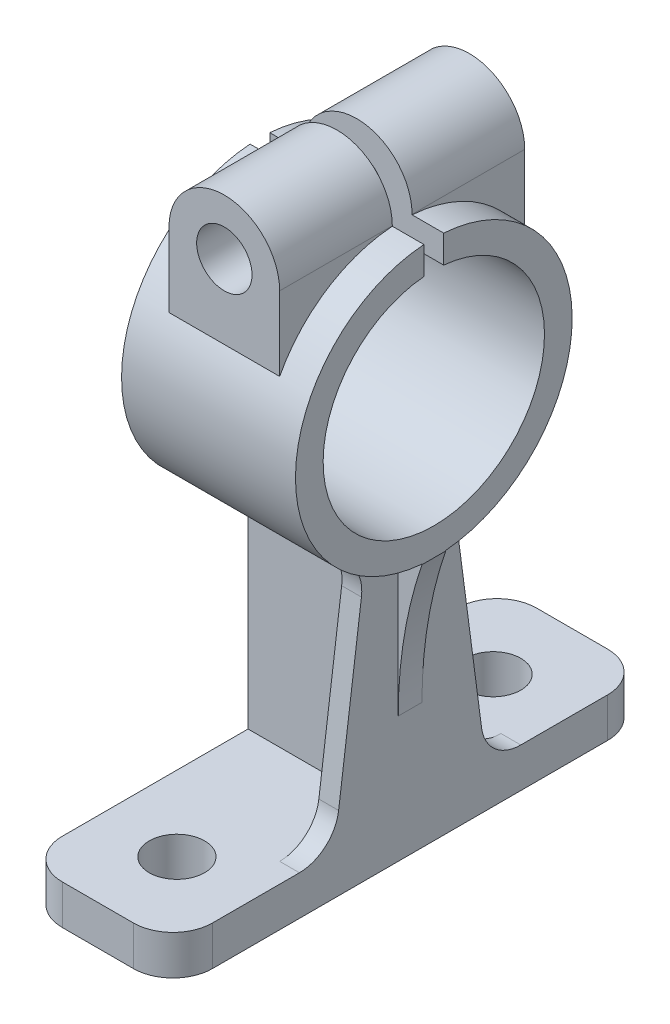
ISO-10303-21;
HEADER;
FILE_DESCRIPTION(('STEP AP214'),'2;1');
FILE_NAME('part.step','',(''),(''),'','','');
FILE_SCHEMA(('AUTOMOTIVE_DESIGN { 1 0 10303 214 1 1 1 1 }'));
ENDSEC;
DATA;
#1=APPLICATION_CONTEXT('core data for automotive mechanical design processes');
#2=APPLICATION_PROTOCOL_DEFINITION('international standard','automotive_design',2000,#1);
#3=PRODUCT_CONTEXT('',#1,'mechanical');
#4=PRODUCT('Part','Part','',(#3));
#5=PRODUCT_RELATED_PRODUCT_CATEGORY('part','',(#4));
#6=PRODUCT_DEFINITION_FORMATION('','',#4);
#7=PRODUCT_DEFINITION_CONTEXT('part definition',#1,'design');
#8=PRODUCT_DEFINITION('design','',#6,#7);
#9=PRODUCT_DEFINITION_SHAPE('','',#8);
#10=(LENGTH_UNIT() NAMED_UNIT(*) SI_UNIT(.MILLI.,.METRE.));
#11=(NAMED_UNIT(*) PLANE_ANGLE_UNIT() SI_UNIT($,.RADIAN.));
#12=(NAMED_UNIT(*) SI_UNIT($,.STERADIAN.) SOLID_ANGLE_UNIT());
#13=UNCERTAINTY_MEASURE_WITH_UNIT(LENGTH_MEASURE(1.E-05),#10,'distance_accuracy_value','');
#14=(GEOMETRIC_REPRESENTATION_CONTEXT(3) GLOBAL_UNCERTAINTY_ASSIGNED_CONTEXT((#13)) GLOBAL_UNIT_ASSIGNED_CONTEXT((#10,
#11,#12)) REPRESENTATION_CONTEXT('',''));
#15=CARTESIAN_POINT('',(0.,0.,0.));
#16=DIRECTION('',(0.,0.,1.));
#17=DIRECTION('',(1.,0.,0.));
#18=AXIS2_PLACEMENT_3D('',#15,#16,#17);
#19=CARTESIAN_POINT('',(-38.,103.,0.));
#20=DIRECTION('',(1.,0.,0.));
#21=DIRECTION('',(0.,0.,-1.));
#22=AXIS2_PLACEMENT_3D('',#19,#20,#21);
#23=CYLINDRICAL_SURFACE('',#22,35.);
#24=DIRECTION('',(1.,0.,0.));
#25=VECTOR('',#24,1.);
#26=CARTESIAN_POINT('',(-38.,137.910600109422,-2.5));
#27=LINE('',#26,#25);
#28=CARTESIAN_POINT('',(-1.99999999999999,137.910600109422,-2.5));
#29=VERTEX_POINT('',#28);
#30=CARTESIAN_POINT('',(6.00000000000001,137.910600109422,-2.5));
#31=VERTEX_POINT('',#30);
#32=EDGE_CURVE('E285',#29,#31,#27,.T.);
#33=ORIENTED_EDGE('',*,*,#32,.T.);
#34=CARTESIAN_POINT('',(6.00000000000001,103.,0.));
#35=DIRECTION('',(-1.,0.,0.));
#36=DIRECTION('',(0.,0.,1.));
#37=AXIS2_PLACEMENT_3D('',#34,#35,#36);
#38=CIRCLE('',#37,35.);
#39=CARTESIAN_POINT('',(6.00000000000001,68.1288084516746,-3.));
#40=VERTEX_POINT('',#39);
#41=EDGE_CURVE('E298',#31,#40,#38,.T.);
#42=ORIENTED_EDGE('',*,*,#41,.T.);
#43=DIRECTION('',(1.,0.,0.));
#44=VECTOR('',#43,1.);
#45=CARTESIAN_POINT('',(-38.,68.1288084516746,-3.));
#46=LINE('',#45,#44);
#47=CARTESIAN_POINT('',(0.,68.1288084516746,-3.));
#48=VERTEX_POINT('',#47);
#49=EDGE_CURVE('E511',#48,#40,#46,.T.);
#50=ORIENTED_EDGE('',*,*,#49,.F.);
#51=CARTESIAN_POINT('',(0.,103.,0.));
#52=DIRECTION('',(-1.,0.,0.));
#53=DIRECTION('',(0.,0.,-1.));
#54=AXIS2_PLACEMENT_3D('',#51,#52,#53);
#55=CIRCLE('',#54,35.);
#56=CARTESIAN_POINT('',(0.,72.5663052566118,-17.2855495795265));
#57=VERTEX_POINT('',#56);
#58=EDGE_CURVE('E341',#57,#48,#55,.T.);
#59=ORIENTED_EDGE('',*,*,#58,.F.);
#60=DIRECTION('',(1.,0.,0.));
#61=VECTOR('',#60,1.);
#62=CARTESIAN_POINT('',(-5.,72.5663052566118,-17.2855495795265));
#63=LINE('',#62,#61);
#64=CARTESIAN_POINT('',(-5.,72.5663052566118,-17.2855495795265));
#65=VERTEX_POINT('',#64);
#66=EDGE_CURVE('E374',#65,#57,#63,.T.);
#67=ORIENTED_EDGE('',*,*,#66,.F.);
#68=CARTESIAN_POINT('',(-5.,103.,0.));
#69=DIRECTION('',(-1.,0.,0.));
#70=DIRECTION('',(0.,0.,-1.));
#71=AXIS2_PLACEMENT_3D('',#68,#69,#70);
#72=CIRCLE('',#71,35.);
#73=CARTESIAN_POINT('',(-5.,68.1288084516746,-3.));
#74=VERTEX_POINT('',#73);
#75=EDGE_CURVE('E366',#65,#74,#72,.T.);
#76=ORIENTED_EDGE('',*,*,#75,.T.);
#77=DIRECTION('',(1.,0.,0.));
#78=VECTOR('',#77,1.);
#79=CARTESIAN_POINT('',(-38.,68.1288084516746,-3.));
#80=LINE('',#79,#78);
#81=CARTESIAN_POINT('',(-38.,68.1288084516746,-3.));
#82=VERTEX_POINT('',#81);
#83=EDGE_CURVE('E315',#74,#82,#80,.F.);
#84=ORIENTED_EDGE('',*,*,#83,.T.);
#85=CARTESIAN_POINT('',(-38.,103.,0.));
#86=DIRECTION('',(1.,0.,0.));
#87=DIRECTION('',(0.,0.,-1.));
#88=AXIS2_PLACEMENT_3D('',#85,#86,#87);
#89=CIRCLE('',#88,35.);
#90=CARTESIAN_POINT('',(-38.,137.910600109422,-2.5));
#91=VERTEX_POINT('',#90);
#92=EDGE_CURVE('E319',#82,#91,#89,.T.);
#93=ORIENTED_EDGE('',*,*,#92,.T.);
#94=CARTESIAN_POINT('',(-30.,137.910600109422,-2.5));
#95=VERTEX_POINT('',#94);
#96=EDGE_CURVE('E302',#91,#95,#27,.T.);
#97=ORIENTED_EDGE('',*,*,#96,.T.);
#98=CARTESIAN_POINT('',(-30.,103.,0.));
#99=DIRECTION('',(1.,0.,0.));
#100=DIRECTION('',(0.,0.,-1.));
#101=AXIS2_PLACEMENT_3D('',#98,#99,#100);
#102=CIRCLE('',#101,35.);
#103=CARTESIAN_POINT('',(-30.,119.248076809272,-31.));
#104=VERTEX_POINT('',#103);
#105=EDGE_CURVE('E412',#95,#104,#102,.F.);
#106=ORIENTED_EDGE('',*,*,#105,.T.);
#107=DIRECTION('',(1.,0.,0.));
#108=VECTOR('',#107,1.);
#109=CARTESIAN_POINT('',(-38.,119.248076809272,-31.));
#110=LINE('',#109,#108);
#111=CARTESIAN_POINT('',(-1.99999999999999,119.248076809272,-31.));
#112=VERTEX_POINT('',#111);
#113=EDGE_CURVE('E409',#112,#104,#110,.F.);
#114=ORIENTED_EDGE('',*,*,#113,.F.);
#115=CARTESIAN_POINT('',(-1.99999999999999,103.,0.));
#116=DIRECTION('',(-1.,0.,0.));
#117=DIRECTION('',(0.,-1.,0.));
#118=AXIS2_PLACEMENT_3D('',#115,#116,#117);
#119=CIRCLE('',#118,35.);
#120=EDGE_CURVE('E301',#112,#29,#119,.F.);
#121=ORIENTED_EDGE('',*,*,#120,.T.);
#122=EDGE_LOOP('',(#33,#42,#50,#59,#67,#76,#84,#93,#97,#106,#114,#121));
#123=FACE_BOUND('',#122,.T.);
#124=ADVANCED_FACE('F47',(#123),#23,.T.);
#125=CARTESIAN_POINT('',(-16.,138.,31.));
#126=DIRECTION('',(0.,0.,-1.));
#127=DIRECTION('',(-1.,0.,0.));
#128=AXIS2_PLACEMENT_3D('',#125,#126,#127);
#129=CYLINDRICAL_SURFACE('',#128,14.);
#130=DIRECTION('',(0.,0.,-1.));
#131=VECTOR('',#130,1.);
#132=CARTESIAN_POINT('',(-30.,138.,31.));
#133=LINE('',#132,#131);
#134=CARTESIAN_POINT('',(-30.,138.,-2.5));
#135=VERTEX_POINT('',#134);
#136=CARTESIAN_POINT('',(-30.,138.,-31.));
#137=VERTEX_POINT('',#136);
#138=EDGE_CURVE('E601',#135,#137,#133,.T.);
#139=ORIENTED_EDGE('',*,*,#138,.F.);
#140=CARTESIAN_POINT('',(-16.,138.,-2.5));
#141=DIRECTION('',(0.,0.,-1.));
#142=DIRECTION('',(0.,1.,0.));
#143=AXIS2_PLACEMENT_3D('',#140,#141,#142);
#144=CIRCLE('',#143,14.);
#145=CARTESIAN_POINT('',(-1.99999999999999,138.,-2.5));
#146=VERTEX_POINT('',#145);
#147=EDGE_CURVE('E566',#146,#135,#144,.F.);
#148=ORIENTED_EDGE('',*,*,#147,.F.);
#149=DIRECTION('',(0.,0.,-1.));
#150=VECTOR('',#149,1.);
#151=CARTESIAN_POINT('',(-1.99999999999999,138.,31.));
#152=LINE('',#151,#150);
#153=CARTESIAN_POINT('',(-1.99999999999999,138.,-31.));
#154=VERTEX_POINT('',#153);
#155=EDGE_CURVE('E604',#146,#154,#152,.T.);
#156=ORIENTED_EDGE('',*,*,#155,.T.);
#157=CARTESIAN_POINT('',(-16.,138.,-31.));
#158=DIRECTION('',(0.,0.,1.));
#159=DIRECTION('',(-1.,0.,0.));
#160=AXIS2_PLACEMENT_3D('',#157,#158,#159);
#161=CIRCLE('',#160,14.);
#162=EDGE_CURVE('E588',#154,#137,#161,.T.);
#163=ORIENTED_EDGE('',*,*,#162,.T.);
#164=EDGE_LOOP('',(#139,#148,#156,#163));
#165=FACE_BOUND('',#164,.T.);
#166=ADVANCED_FACE('F614',(#165),#129,.T.);
#167=DIRECTION('',(1.,0.,0.));
#168=VECTOR('',#167,1.);
#169=CARTESIAN_POINT('',(-38.,137.910600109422,2.5));
#170=LINE('',#169,#168);
#171=CARTESIAN_POINT('',(-30.,137.910600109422,2.5));
#172=VERTEX_POINT('',#171);
#173=CARTESIAN_POINT('',(-38.,137.910600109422,2.5));
#174=VERTEX_POINT('',#173);
#175=EDGE_CURVE('E627',#172,#174,#170,.F.);
#176=ORIENTED_EDGE('',*,*,#175,.T.);
#177=CARTESIAN_POINT('',(-38.,68.1288084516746,3.));
#178=VERTEX_POINT('',#177);
#179=EDGE_CURVE('E313',#174,#178,#89,.T.);
#180=ORIENTED_EDGE('',*,*,#179,.T.);
#181=DIRECTION('',(1.,0.,0.));
#182=VECTOR('',#181,1.);
#183=CARTESIAN_POINT('',(-38.,68.1288084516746,3.));
#184=LINE('',#183,#182);
#185=CARTESIAN_POINT('',(-5.,68.1288084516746,3.));
#186=VERTEX_POINT('',#185);
#187=EDGE_CURVE('E310',#186,#178,#184,.F.);
#188=ORIENTED_EDGE('',*,*,#187,.F.);
#189=CARTESIAN_POINT('',(-5.,72.5663052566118,17.2855495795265));
#190=VERTEX_POINT('',#189);
#191=EDGE_CURVE('E365',#186,#190,#72,.T.);
#192=ORIENTED_EDGE('',*,*,#191,.T.);
#193=DIRECTION('',(1.,0.,0.));
#194=VECTOR('',#193,1.);
#195=CARTESIAN_POINT('',(-5.,72.5663052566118,17.2855495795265));
#196=LINE('',#195,#194);
#197=CARTESIAN_POINT('',(0.,72.5663052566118,17.2855495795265));
#198=VERTEX_POINT('',#197);
#199=EDGE_CURVE('E370',#190,#198,#196,.T.);
#200=ORIENTED_EDGE('',*,*,#199,.T.);
#201=CARTESIAN_POINT('',(0.,68.1288084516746,3.));
#202=VERTEX_POINT('',#201);
#203=EDGE_CURVE('E340',#202,#198,#55,.T.);
#204=ORIENTED_EDGE('',*,*,#203,.F.);
#205=DIRECTION('',(1.,0.,0.));
#206=VECTOR('',#205,1.);
#207=CARTESIAN_POINT('',(-38.,68.1288084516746,3.));
#208=LINE('',#207,#206);
#209=CARTESIAN_POINT('',(6.00000000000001,68.1288084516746,3.));
#210=VERTEX_POINT('',#209);
#211=EDGE_CURVE('E539',#202,#210,#208,.T.);
#212=ORIENTED_EDGE('',*,*,#211,.T.);
#213=CARTESIAN_POINT('',(6.,137.910600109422,2.5));
#214=VERTEX_POINT('',#213);
#215=EDGE_CURVE('E309',#210,#214,#38,.T.);
#216=ORIENTED_EDGE('',*,*,#215,.T.);
#217=CARTESIAN_POINT('',(-1.99999999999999,137.910600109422,2.5));
#218=VERTEX_POINT('',#217);
#219=EDGE_CURVE('E303',#214,#218,#170,.F.);
#220=ORIENTED_EDGE('',*,*,#219,.T.);
#221=CARTESIAN_POINT('',(-1.99999999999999,119.248076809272,31.));
#222=VERTEX_POINT('',#221);
#223=EDGE_CURVE('E417',#218,#222,#119,.F.);
#224=ORIENTED_EDGE('',*,*,#223,.T.);
#225=DIRECTION('',(1.,0.,0.));
#226=VECTOR('',#225,1.);
#227=CARTESIAN_POINT('',(-38.,119.248076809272,31.));
#228=LINE('',#227,#226);
#229=CARTESIAN_POINT('',(-30.,119.248076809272,31.));
#230=VERTEX_POINT('',#229);
#231=EDGE_CURVE('E416',#222,#230,#228,.F.);
#232=ORIENTED_EDGE('',*,*,#231,.T.);
#233=EDGE_CURVE('E414',#230,#172,#102,.F.);
#234=ORIENTED_EDGE('',*,*,#233,.T.);
#235=EDGE_LOOP('',(#176,#180,#188,#192,#200,#204,#212,#216,#220,#224,#232,#234));
#236=FACE_BOUND('',#235,.T.);
#237=ADVANCED_FACE('F673',(#236),#23,.T.);
#238=CARTESIAN_POINT('',(0.,10.,-60.));
#239=DIRECTION('',(-1.,0.,0.));
#240=DIRECTION('',(0.,0.,1.));
#241=AXIS2_PLACEMENT_3D('',#238,#239,#240);
#242=PLANE('',#241);
#243=DIRECTION('',(0.,0.,-1.));
#244=VECTOR('',#243,1.);
#245=CARTESIAN_POINT('',(0.,0.,-60.));
#246=LINE('',#245,#244);
#247=CARTESIAN_POINT('',(0.,0.,50.));
#248=VERTEX_POINT('',#247);
#249=CARTESIAN_POINT('',(0.,0.,-50.));
#250=VERTEX_POINT('',#249);
#251=EDGE_CURVE('E392',#248,#250,#246,.T.);
#252=ORIENTED_EDGE('',*,*,#251,.T.);
#253=DIRECTION('',(0.,-1.,0.));
#254=VECTOR('',#253,1.);
#255=CARTESIAN_POINT('',(0.,10.,-50.));
#256=LINE('',#255,#254);
#257=CARTESIAN_POINT('',(0.,10.,-50.));
#258=VERTEX_POINT('',#257);
#259=EDGE_CURVE('E440',#250,#258,#256,.F.);
#260=ORIENTED_EDGE('',*,*,#259,.T.);
#261=DIRECTION('',(0.,0.,-1.));
#262=VECTOR('',#261,1.);
#263=CARTESIAN_POINT('',(0.,10.,-60.));
#264=LINE('',#263,#262);
#265=CARTESIAN_POINT('',(0.,10.,-28.));
#266=VERTEX_POINT('',#265);
#267=EDGE_CURVE('E403',#266,#258,#264,.T.);
#268=ORIENTED_EDGE('',*,*,#267,.F.);
#269=CARTESIAN_POINT('',(0.,20.,-28.));
#270=DIRECTION('',(-1.,0.,0.));
#271=DIRECTION('',(0.,0.,-1.));
#272=AXIS2_PLACEMENT_3D('',#269,#270,#271);
#273=CIRCLE('',#272,10.);
#274=CARTESIAN_POINT('',(0.,18.6947380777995,-18.0855513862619));
#275=VERTEX_POINT('',#274);
#276=EDGE_CURVE('E331',#266,#275,#273,.T.);
#277=ORIENTED_EDGE('',*,*,#276,.T.);
#278=DIRECTION('',(0.,0.99144486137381,0.130526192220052));
#279=VECTOR('',#278,1.);
#280=CARTESIAN_POINT('',(0.,62.5657019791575,-12.3098294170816));
#281=LINE('',#280,#279);
#282=CARTESIAN_POINT('',(0.,62.5657019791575,-12.3098294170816));
#283=VERTEX_POINT('',#282);
#284=EDGE_CURVE('E334',#275,#283,#281,.T.);
#285=ORIENTED_EDGE('',*,*,#284,.T.);
#286=CARTESIAN_POINT('',(0.,63.870963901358,-22.2242780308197));
#287=DIRECTION('',(-1.,0.,0.));
#288=DIRECTION('',(0.,0.,1.));
#289=AXIS2_PLACEMENT_3D('',#286,#287,#288);
#290=CIRCLE('',#289,10.);
#291=EDGE_CURVE('E337',#283,#57,#290,.T.);
#292=ORIENTED_EDGE('',*,*,#291,.T.);
#293=ORIENTED_EDGE('',*,*,#58,.T.);
#294=DIRECTION('',(0.,-1.,0.));
#295=VECTOR('',#294,1.);
#296=CARTESIAN_POINT('',(0.,72.5663052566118,-3.));
#297=LINE('',#296,#295);
#298=CARTESIAN_POINT('',(0.,31.8337173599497,-3.));
#299=VERTEX_POINT('',#298);
#300=EDGE_CURVE('E513',#48,#299,#297,.T.);
#301=ORIENTED_EDGE('',*,*,#300,.T.);
#302=DIRECTION('',(0.,0.,-1.));
#303=VECTOR('',#302,1.);
#304=CARTESIAN_POINT('',(0.,31.8337173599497,3.));
#305=LINE('',#304,#303);
#306=CARTESIAN_POINT('',(0.,31.8337173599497,3.));
#307=VERTEX_POINT('',#306);
#308=EDGE_CURVE('E536',#307,#299,#305,.T.);
#309=ORIENTED_EDGE('',*,*,#308,.F.);
#310=DIRECTION('',(0.,-1.,0.));
#311=VECTOR('',#310,1.);
#312=CARTESIAN_POINT('',(0.,72.5663052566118,3.));
#313=LINE('',#312,#311);
#314=EDGE_CURVE('E529',#202,#307,#313,.T.);
#315=ORIENTED_EDGE('',*,*,#314,.F.);
#316=ORIENTED_EDGE('',*,*,#203,.T.);
#317=CARTESIAN_POINT('',(0.,63.870963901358,22.2242780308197));
#318=DIRECTION('',(-1.,0.,0.));
#319=DIRECTION('',(0.,0.,-1.));
#320=AXIS2_PLACEMENT_3D('',#317,#318,#319);
#321=CIRCLE('',#320,10.);
#322=CARTESIAN_POINT('',(0.,62.5657019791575,12.3098294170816));
#323=VERTEX_POINT('',#322);
#324=EDGE_CURVE('E322',#198,#323,#321,.T.);
#325=ORIENTED_EDGE('',*,*,#324,.T.);
#326=DIRECTION('',(0.,-0.99144486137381,0.130526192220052));
#327=VECTOR('',#326,1.);
#328=CARTESIAN_POINT('',(0.,62.5657019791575,12.3098294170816));
#329=LINE('',#328,#327);
#330=CARTESIAN_POINT('',(0.,18.6947380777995,18.0855513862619));
#331=VERTEX_POINT('',#330);
#332=EDGE_CURVE('E325',#323,#331,#329,.T.);
#333=ORIENTED_EDGE('',*,*,#332,.T.);
#334=CARTESIAN_POINT('',(0.,20.,28.));
#335=DIRECTION('',(-1.,0.,0.));
#336=DIRECTION('',(0.,0.,1.));
#337=AXIS2_PLACEMENT_3D('',#334,#335,#336);
#338=CIRCLE('',#337,10.);
#339=CARTESIAN_POINT('',(0.,10.,28.));
#340=VERTEX_POINT('',#339);
#341=EDGE_CURVE('E328',#331,#340,#338,.T.);
#342=ORIENTED_EDGE('',*,*,#341,.T.);
#343=CARTESIAN_POINT('',(0.,10.,50.));
#344=VERTEX_POINT('',#343);
#345=EDGE_CURVE('E404',#344,#340,#264,.T.);
#346=ORIENTED_EDGE('',*,*,#345,.F.);
#347=DIRECTION('',(0.,-1.,0.));
#348=VECTOR('',#347,1.);
#349=CARTESIAN_POINT('',(0.,10.,50.));
#350=LINE('',#349,#348);
#351=EDGE_CURVE('E437',#344,#248,#350,.T.);
#352=ORIENTED_EDGE('',*,*,#351,.T.);
#353=EDGE_LOOP('',(#252,#260,#268,#277,#285,#292,#293,#301,#309,#315,#316,#325,#333,#342,#346,#352));
#354=FACE_BOUND('',#353,.T.);
#355=ADVANCED_FACE('F460',(#354),#242,.F.);
#356=CARTESIAN_POINT('',(-38.,10.,60.));
#357=DIRECTION('',(0.,1.,0.));
#358=DIRECTION('',(0.,0.,1.));
#359=AXIS2_PLACEMENT_3D('',#356,#357,#358);
#360=PLANE('',#359);
#361=CARTESIAN_POINT('',(-19.,10.,-40.));
#362=DIRECTION('',(0.,1.,0.));
#363=DIRECTION('',(0.,0.,1.));
#364=AXIS2_PLACEMENT_3D('',#361,#362,#363);
#365=CIRCLE('',#364,6.99999999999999);
#366=CARTESIAN_POINT('',(-19.,10.,-33.));
#367=VERTEX_POINT('',#366);
#368=EDGE_CURVE('E637',#367,#367,#365,.T.);
#369=ORIENTED_EDGE('',*,*,#368,.F.);
#370=EDGE_LOOP('',(#369));
#371=FACE_BOUND('',#370,.T.);
#372=ORIENTED_EDGE('',*,*,#267,.T.);
#373=CARTESIAN_POINT('',(-10.,10.,-50.));
#374=DIRECTION('',(0.,1.,0.));
#375=DIRECTION('',(0.,0.,1.));
#376=AXIS2_PLACEMENT_3D('',#373,#374,#375);
#377=CIRCLE('',#376,10.);
#378=CARTESIAN_POINT('',(-10.,10.,-60.));
#379=VERTEX_POINT('',#378);
#380=EDGE_CURVE('E444',#258,#379,#377,.T.);
#381=ORIENTED_EDGE('',*,*,#380,.T.);
#382=DIRECTION('',(-1.,0.,0.));
#383=VECTOR('',#382,1.);
#384=CARTESIAN_POINT('',(-38.,10.,-60.));
#385=LINE('',#384,#383);
#386=CARTESIAN_POINT('',(-28.,10.,-60.));
#387=VERTEX_POINT('',#386);
#388=EDGE_CURVE('E406',#379,#387,#385,.T.);
#389=ORIENTED_EDGE('',*,*,#388,.T.);
#390=CARTESIAN_POINT('',(-28.,10.,-50.));
#391=DIRECTION('',(0.,1.,0.));
#392=DIRECTION('',(0.,0.,1.));
#393=AXIS2_PLACEMENT_3D('',#390,#391,#392);
#394=CIRCLE('',#393,10.);
#395=CARTESIAN_POINT('',(-38.,10.,-50.));
#396=VERTEX_POINT('',#395);
#397=EDGE_CURVE('E442',#387,#396,#394,.T.);
#398=ORIENTED_EDGE('',*,*,#397,.T.);
#399=DIRECTION('',(0.,0.,1.));
#400=VECTOR('',#399,1.);
#401=CARTESIAN_POINT('',(-38.,10.,-60.));
#402=LINE('',#401,#400);
#403=CARTESIAN_POINT('',(-38.,10.,-3.));
#404=VERTEX_POINT('',#403);
#405=EDGE_CURVE('E399',#396,#404,#402,.T.);
#406=ORIENTED_EDGE('',*,*,#405,.T.);
#407=DIRECTION('',(1.,0.,0.));
#408=VECTOR('',#407,1.);
#409=CARTESIAN_POINT('',(-38.,10.,-3.));
#410=LINE('',#409,#408);
#411=CARTESIAN_POINT('',(-5.,10.,-3.));
#412=VERTEX_POINT('',#411);
#413=EDGE_CURVE('E541',#404,#412,#410,.T.);
#414=ORIENTED_EDGE('',*,*,#413,.T.);
#415=DIRECTION('',(0.,0.,-1.));
#416=VECTOR('',#415,1.);
#417=CARTESIAN_POINT('',(-5.,10.,28.));
#418=LINE('',#417,#416);
#419=CARTESIAN_POINT('',(-5.,10.,-28.));
#420=VERTEX_POINT('',#419);
#421=EDGE_CURVE('E353',#412,#420,#418,.T.);
#422=ORIENTED_EDGE('',*,*,#421,.T.);
#423=DIRECTION('',(1.,0.,0.));
#424=VECTOR('',#423,1.);
#425=CARTESIAN_POINT('',(-5.,10.,-28.));
#426=LINE('',#425,#424);
#427=EDGE_CURVE('E380',#420,#266,#426,.T.);
#428=ORIENTED_EDGE('',*,*,#427,.T.);
#429=EDGE_LOOP('',(#372,#381,#389,#398,#406,#414,#422,#428));
#430=FACE_BOUND('',#429,.T.);
#431=ADVANCED_FACE('F491',(#371,#430),#360,.T.);
#432=CARTESIAN_POINT('',(-5.,63.870963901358,22.2242780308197));
#433=DIRECTION('',(1.,0.,0.));
#434=DIRECTION('',(0.,0.,-1.));
#435=AXIS2_PLACEMENT_3D('',#432,#433,#434);
#436=PLANE('',#435);
#437=DIRECTION('',(0.,1.,0.));
#438=VECTOR('',#437,1.);
#439=CARTESIAN_POINT('',(-5.,72.5663052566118,-3.));
#440=LINE('',#439,#438);
#441=EDGE_CURVE('E543',#412,#74,#440,.T.);
#442=ORIENTED_EDGE('',*,*,#441,.T.);
#443=ORIENTED_EDGE('',*,*,#75,.F.);
#444=CARTESIAN_POINT('',(-5.,63.870963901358,-22.2242780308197));
#445=DIRECTION('',(-1.,0.,0.));
#446=DIRECTION('',(0.,0.,1.));
#447=AXIS2_PLACEMENT_3D('',#444,#445,#446);
#448=CIRCLE('',#447,10.);
#449=CARTESIAN_POINT('',(-5.,62.5657019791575,-12.3098294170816));
#450=VERTEX_POINT('',#449);
#451=EDGE_CURVE('E363',#450,#65,#448,.T.);
#452=ORIENTED_EDGE('',*,*,#451,.F.);
#453=DIRECTION('',(0.,0.99144486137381,0.130526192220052));
#454=VECTOR('',#453,1.);
#455=CARTESIAN_POINT('',(-5.,62.5657019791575,-12.3098294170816));
#456=LINE('',#455,#454);
#457=CARTESIAN_POINT('',(-5.,18.6947380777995,-18.0855513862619));
#458=VERTEX_POINT('',#457);
#459=EDGE_CURVE('E360',#458,#450,#456,.T.);
#460=ORIENTED_EDGE('',*,*,#459,.F.);
#461=CARTESIAN_POINT('',(-5.,20.,-28.));
#462=DIRECTION('',(-1.,0.,0.));
#463=DIRECTION('',(0.,0.,-1.));
#464=AXIS2_PLACEMENT_3D('',#461,#462,#463);
#465=CIRCLE('',#464,10.);
#466=EDGE_CURVE('E357',#420,#458,#465,.T.);
#467=ORIENTED_EDGE('',*,*,#466,.F.);
#468=ORIENTED_EDGE('',*,*,#421,.F.);
#469=EDGE_LOOP('',(#442,#443,#452,#460,#467,#468));
#470=FACE_BOUND('',#469,.T.);
#471=ADVANCED_FACE('F669',(#470),#436,.F.);
#472=CARTESIAN_POINT('',(-38.,10.,-60.));
#473=DIRECTION('',(1.,0.,0.));
#474=DIRECTION('',(0.,0.,-1.));
#475=AXIS2_PLACEMENT_3D('',#472,#473,#474);
#476=PLANE('',#475);
#477=ORIENTED_EDGE('',*,*,#405,.F.);
#478=DIRECTION('',(0.,-1.,0.));
#479=VECTOR('',#478,1.);
#480=CARTESIAN_POINT('',(-38.,10.,-50.));
#481=LINE('',#480,#479);
#482=CARTESIAN_POINT('',(-38.,0.,-50.));
#483=VERTEX_POINT('',#482);
#484=EDGE_CURVE('E14',#396,#483,#481,.T.);
#485=ORIENTED_EDGE('',*,*,#484,.T.);
#486=DIRECTION('',(0.,0.,1.));
#487=VECTOR('',#486,1.);
#488=CARTESIAN_POINT('',(-38.,0.,-60.));
#489=LINE('',#488,#487);
#490=CARTESIAN_POINT('',(-38.,0.,50.));
#491=VERTEX_POINT('',#490);
#492=EDGE_CURVE('E373',#483,#491,#489,.T.);
#493=ORIENTED_EDGE('',*,*,#492,.T.);
#494=DIRECTION('',(0.,-1.,0.));
#495=VECTOR('',#494,1.);
#496=CARTESIAN_POINT('',(-38.,10.,50.));
#497=LINE('',#496,#495);
#498=CARTESIAN_POINT('',(-38.,10.,50.));
#499=VERTEX_POINT('',#498);
#500=EDGE_CURVE('E55',#491,#499,#497,.F.);
#501=ORIENTED_EDGE('',*,*,#500,.T.);
#502=CARTESIAN_POINT('',(-38.,10.,3.));
#503=VERTEX_POINT('',#502);
#504=EDGE_CURVE('E398',#503,#499,#402,.T.);
#505=ORIENTED_EDGE('',*,*,#504,.F.);
#506=DIRECTION('',(0.,-1.,0.));
#507=VECTOR('',#506,1.);
#508=CARTESIAN_POINT('',(-38.,10.,3.));
#509=LINE('',#508,#507);
#510=EDGE_CURVE('E552',#178,#503,#509,.T.);
#511=ORIENTED_EDGE('',*,*,#510,.F.);
#512=ORIENTED_EDGE('',*,*,#179,.F.);
#513=DIRECTION('',(0.,1.,0.));
#514=VECTOR('',#513,1.);
#515=CARTESIAN_POINT('',(-38.,130.888169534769,2.5));
#516=LINE('',#515,#514);
#517=CARTESIAN_POINT('',(-38.,130.888169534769,2.5));
#518=VERTEX_POINT('',#517);
#519=EDGE_CURVE('E579',#518,#174,#516,.T.);
#520=ORIENTED_EDGE('',*,*,#519,.F.);
#521=CARTESIAN_POINT('',(-38.,103.,0.));
#522=DIRECTION('',(1.,0.,0.));
#523=DIRECTION('',(0.,0.,-1.));
#524=AXIS2_PLACEMENT_3D('',#521,#522,#523);
#525=CIRCLE('',#524,28.);
#526=CARTESIAN_POINT('',(-38.,130.888169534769,-2.5));
#527=VERTEX_POINT('',#526);
#528=EDGE_CURVE('E561',#527,#518,#525,.F.);
#529=ORIENTED_EDGE('',*,*,#528,.F.);
#530=DIRECTION('',(0.,-1.,0.));
#531=VECTOR('',#530,1.);
#532=CARTESIAN_POINT('',(-38.,130.888169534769,-2.5));
#533=LINE('',#532,#531);
#534=EDGE_CURVE('E559',#91,#527,#533,.T.);
#535=ORIENTED_EDGE('',*,*,#534,.F.);
#536=ORIENTED_EDGE('',*,*,#92,.F.);
#537=DIRECTION('',(0.,-1.,0.));
#538=VECTOR('',#537,1.);
#539=CARTESIAN_POINT('',(-38.,10.,-3.));
#540=LINE('',#539,#538);
#541=EDGE_CURVE('E546',#82,#404,#540,.T.);
#542=ORIENTED_EDGE('',*,*,#541,.T.);
#543=EDGE_LOOP('',(#477,#485,#493,#501,#505,#511,#512,#520,#529,#535,#536,#542));
#544=FACE_BOUND('',#543,.T.);
#545=ADVANCED_FACE('F49',(#544),#476,.F.);
#546=CARTESIAN_POINT('',(-38.,10.,60.));
#547=DIRECTION('',(0.,0.,-1.));
#548=DIRECTION('',(-1.,0.,0.));
#549=AXIS2_PLACEMENT_3D('',#546,#547,#548);
#550=PLANE('',#549);
#551=DIRECTION('',(1.,0.,0.));
#552=VECTOR('',#551,1.);
#553=CARTESIAN_POINT('',(-38.,0.,60.));
#554=LINE('',#553,#552);
#555=CARTESIAN_POINT('',(-28.,0.,60.));
#556=VERTEX_POINT('',#555);
#557=CARTESIAN_POINT('',(-10.,0.,60.));
#558=VERTEX_POINT('',#557);
#559=EDGE_CURVE('E390',#556,#558,#554,.T.);
#560=ORIENTED_EDGE('',*,*,#559,.T.);
#561=DIRECTION('',(0.,-1.,0.));
#562=VECTOR('',#561,1.);
#563=CARTESIAN_POINT('',(-10.,10.,60.));
#564=LINE('',#563,#562);
#565=CARTESIAN_POINT('',(-10.,10.,60.));
#566=VERTEX_POINT('',#565);
#567=EDGE_CURVE('E69',#558,#566,#564,.F.);
#568=ORIENTED_EDGE('',*,*,#567,.T.);
#569=DIRECTION('',(1.,0.,0.));
#570=VECTOR('',#569,1.);
#571=CARTESIAN_POINT('',(-38.,10.,60.));
#572=LINE('',#571,#570);
#573=CARTESIAN_POINT('',(-28.,10.,60.));
#574=VERTEX_POINT('',#573);
#575=EDGE_CURVE('E401',#574,#566,#572,.T.);
#576=ORIENTED_EDGE('',*,*,#575,.F.);
#577=DIRECTION('',(0.,-1.,0.));
#578=VECTOR('',#577,1.);
#579=CARTESIAN_POINT('',(-28.,10.,60.));
#580=LINE('',#579,#578);
#581=EDGE_CURVE('E446',#574,#556,#580,.T.);
#582=ORIENTED_EDGE('',*,*,#581,.T.);
#583=EDGE_LOOP('',(#560,#568,#576,#582));
#584=FACE_BOUND('',#583,.T.);
#585=ADVANCED_FACE('F468',(#584),#550,.F.);
#586=CARTESIAN_POINT('',(-38.,10.,-60.));
#587=DIRECTION('',(0.,0.,1.));
#588=DIRECTION('',(1.,0.,0.));
#589=AXIS2_PLACEMENT_3D('',#586,#587,#588);
#590=PLANE('',#589);
#591=ORIENTED_EDGE('',*,*,#388,.F.);
#592=DIRECTION('',(0.,-1.,0.));
#593=VECTOR('',#592,1.);
#594=CARTESIAN_POINT('',(-10.,10.,-60.));
#595=LINE('',#594,#593);
#596=CARTESIAN_POINT('',(-10.,0.,-60.));
#597=VERTEX_POINT('',#596);
#598=EDGE_CURVE('E426',#379,#597,#595,.T.);
#599=ORIENTED_EDGE('',*,*,#598,.T.);
#600=DIRECTION('',(-1.,0.,0.));
#601=VECTOR('',#600,1.);
#602=CARTESIAN_POINT('',(-38.,0.,-60.));
#603=LINE('',#602,#601);
#604=CARTESIAN_POINT('',(-28.,0.,-60.));
#605=VERTEX_POINT('',#604);
#606=EDGE_CURVE('E395',#597,#605,#603,.T.);
#607=ORIENTED_EDGE('',*,*,#606,.T.);
#608=DIRECTION('',(0.,-1.,0.));
#609=VECTOR('',#608,1.);
#610=CARTESIAN_POINT('',(-28.,10.,-60.));
#611=LINE('',#610,#609);
#612=EDGE_CURVE('E424',#605,#387,#611,.F.);
#613=ORIENTED_EDGE('',*,*,#612,.T.);
#614=EDGE_LOOP('',(#591,#599,#607,#613));
#615=FACE_BOUND('',#614,.T.);
#616=ADVANCED_FACE('F483',(#615),#590,.F.);
#617=CARTESIAN_POINT('',(-19.,10.,40.));
#618=DIRECTION('',(0.,1.,0.));
#619=DIRECTION('',(0.,0.,1.));
#620=AXIS2_PLACEMENT_3D('',#617,#618,#619);
#621=CIRCLE('',#620,6.99999999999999);
#622=CARTESIAN_POINT('',(-19.,10.,47.));
#623=VERTEX_POINT('',#622);
#624=EDGE_CURVE('E643',#623,#623,#621,.T.);
#625=ORIENTED_EDGE('',*,*,#624,.F.);
#626=EDGE_LOOP('',(#625));
#627=FACE_BOUND('',#626,.T.);
#628=ORIENTED_EDGE('',*,*,#575,.T.);
#629=CARTESIAN_POINT('',(-10.,10.,50.));
#630=DIRECTION('',(0.,1.,0.));
#631=DIRECTION('',(0.,0.,1.));
#632=AXIS2_PLACEMENT_3D('',#629,#630,#631);
#633=CIRCLE('',#632,10.);
#634=EDGE_CURVE('E452',#566,#344,#633,.T.);
#635=ORIENTED_EDGE('',*,*,#634,.T.);
#636=ORIENTED_EDGE('',*,*,#345,.T.);
#637=DIRECTION('',(1.,0.,0.));
#638=VECTOR('',#637,1.);
#639=CARTESIAN_POINT('',(-5.,10.,28.));
#640=LINE('',#639,#638);
#641=CARTESIAN_POINT('',(-5.,10.,28.));
#642=VERTEX_POINT('',#641);
#643=EDGE_CURVE('E383',#642,#340,#640,.T.);
#644=ORIENTED_EDGE('',*,*,#643,.F.);
#645=CARTESIAN_POINT('',(-5.,10.,3.));
#646=VERTEX_POINT('',#645);
#647=EDGE_CURVE('E354',#642,#646,#418,.T.);
#648=ORIENTED_EDGE('',*,*,#647,.T.);
#649=DIRECTION('',(1.,0.,0.));
#650=VECTOR('',#649,1.);
#651=CARTESIAN_POINT('',(-38.,10.,3.));
#652=LINE('',#651,#650);
#653=EDGE_CURVE('E548',#503,#646,#652,.T.);
#654=ORIENTED_EDGE('',*,*,#653,.F.);
#655=ORIENTED_EDGE('',*,*,#504,.T.);
#656=CARTESIAN_POINT('',(-28.,10.,50.));
#657=DIRECTION('',(0.,1.,0.));
#658=DIRECTION('',(0.,0.,1.));
#659=AXIS2_PLACEMENT_3D('',#656,#657,#658);
#660=CIRCLE('',#659,10.);
#661=EDGE_CURVE('E450',#499,#574,#660,.T.);
#662=ORIENTED_EDGE('',*,*,#661,.T.);
#663=EDGE_LOOP('',(#628,#635,#636,#644,#648,#654,#655,#662));
#664=FACE_BOUND('',#663,.T.);
#665=ADVANCED_FACE('F456',(#627,#664),#360,.T.);
#666=CARTESIAN_POINT('',(-38.,0.,60.));
#667=DIRECTION('',(0.,1.,0.));
#668=DIRECTION('',(0.,0.,1.));
#669=AXIS2_PLACEMENT_3D('',#666,#667,#668);
#670=PLANE('',#669);
#671=CARTESIAN_POINT('',(-19.,0.,40.));
#672=DIRECTION('',(0.,1.,0.));
#673=DIRECTION('',(0.,0.,1.));
#674=AXIS2_PLACEMENT_3D('',#671,#672,#673);
#675=CIRCLE('',#674,6.99999999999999);
#676=CARTESIAN_POINT('',(-19.,0.,47.));
#677=VERTEX_POINT('',#676);
#678=EDGE_CURVE('E646',#677,#677,#675,.T.);
#679=ORIENTED_EDGE('',*,*,#678,.T.);
#680=EDGE_LOOP('',(#679));
#681=FACE_BOUND('',#680,.T.);
#682=CARTESIAN_POINT('',(-19.,0.,-40.));
#683=DIRECTION('',(0.,1.,0.));
#684=DIRECTION('',(0.,0.,1.));
#685=AXIS2_PLACEMENT_3D('',#682,#683,#684);
#686=CIRCLE('',#685,6.99999999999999);
#687=CARTESIAN_POINT('',(-19.,0.,-33.));
#688=VERTEX_POINT('',#687);
#689=EDGE_CURVE('E640',#688,#688,#686,.T.);
#690=ORIENTED_EDGE('',*,*,#689,.T.);
#691=EDGE_LOOP('',(#690));
#692=FACE_BOUND('',#691,.T.);
#693=ORIENTED_EDGE('',*,*,#606,.F.);
#694=CARTESIAN_POINT('',(-10.,0.,-50.));
#695=DIRECTION('',(0.,1.,0.));
#696=DIRECTION('',(0.,0.,1.));
#697=AXIS2_PLACEMENT_3D('',#694,#695,#696);
#698=CIRCLE('',#697,10.);
#699=EDGE_CURVE('E435',#597,#250,#698,.F.);
#700=ORIENTED_EDGE('',*,*,#699,.T.);
#701=ORIENTED_EDGE('',*,*,#251,.F.);
#702=CARTESIAN_POINT('',(-10.,0.,50.));
#703=DIRECTION('',(0.,1.,0.));
#704=DIRECTION('',(0.,0.,1.));
#705=AXIS2_PLACEMENT_3D('',#702,#703,#704);
#706=CIRCLE('',#705,10.);
#707=EDGE_CURVE('E433',#248,#558,#706,.F.);
#708=ORIENTED_EDGE('',*,*,#707,.T.);
#709=ORIENTED_EDGE('',*,*,#559,.F.);
#710=CARTESIAN_POINT('',(-28.,0.,50.));
#711=DIRECTION('',(0.,1.,0.));
#712=DIRECTION('',(0.,0.,1.));
#713=AXIS2_PLACEMENT_3D('',#710,#711,#712);
#714=CIRCLE('',#713,10.);
#715=EDGE_CURVE('E429',#556,#491,#714,.F.);
#716=ORIENTED_EDGE('',*,*,#715,.T.);
#717=ORIENTED_EDGE('',*,*,#492,.F.);
#718=CARTESIAN_POINT('',(-28.,0.,-50.));
#719=DIRECTION('',(0.,1.,0.));
#720=DIRECTION('',(0.,0.,1.));
#721=AXIS2_PLACEMENT_3D('',#718,#719,#720);
#722=CIRCLE('',#721,10.);
#723=EDGE_CURVE('E431',#483,#605,#722,.F.);
#724=ORIENTED_EDGE('',*,*,#723,.T.);
#725=EDGE_LOOP('',(#693,#700,#701,#708,#709,#716,#717,#724));
#726=FACE_BOUND('',#725,.T.);
#727=ADVANCED_FACE('F467',(#681,#692,#726),#670,.F.);
#728=CARTESIAN_POINT('',(-5.,63.870963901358,22.2242780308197));
#729=DIRECTION('',(1.,0.,0.));
#730=DIRECTION('',(0.,0.,-1.));
#731=AXIS2_PLACEMENT_3D('',#728,#729,#730);
#732=CYLINDRICAL_SURFACE('',#731,10.);
#733=ORIENTED_EDGE('',*,*,#324,.F.);
#734=ORIENTED_EDGE('',*,*,#199,.F.);
#735=CARTESIAN_POINT('',(-5.,63.870963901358,22.2242780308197));
#736=DIRECTION('',(-1.,0.,0.));
#737=DIRECTION('',(0.,0.,-1.));
#738=AXIS2_PLACEMENT_3D('',#735,#736,#737);
#739=CIRCLE('',#738,10.);
#740=CARTESIAN_POINT('',(-5.,62.5657019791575,12.3098294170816));
#741=VERTEX_POINT('',#740);
#742=EDGE_CURVE('E344',#190,#741,#739,.T.);
#743=ORIENTED_EDGE('',*,*,#742,.T.);
#744=DIRECTION('',(1.,0.,0.));
#745=VECTOR('',#744,1.);
#746=CARTESIAN_POINT('',(-5.,62.5657019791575,12.3098294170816));
#747=LINE('',#746,#745);
#748=EDGE_CURVE('E369',#741,#323,#747,.T.);
#749=ORIENTED_EDGE('',*,*,#748,.T.);
#750=EDGE_LOOP('',(#733,#734,#743,#749));
#751=FACE_BOUND('',#750,.T.);
#752=ADVANCED_FACE('F665',(#751),#732,.F.);
#753=CARTESIAN_POINT('',(-5.,63.870963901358,-22.2242780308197));
#754=DIRECTION('',(1.,0.,0.));
#755=DIRECTION('',(0.,0.,-1.));
#756=AXIS2_PLACEMENT_3D('',#753,#754,#755);
#757=CYLINDRICAL_SURFACE('',#756,10.);
#758=ORIENTED_EDGE('',*,*,#291,.F.);
#759=DIRECTION('',(1.,0.,0.));
#760=VECTOR('',#759,1.);
#761=CARTESIAN_POINT('',(-5.,62.5657019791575,-12.3098294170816));
#762=LINE('',#761,#760);
#763=EDGE_CURVE('E376',#450,#283,#762,.T.);
#764=ORIENTED_EDGE('',*,*,#763,.F.);
#765=ORIENTED_EDGE('',*,*,#451,.T.);
#766=ORIENTED_EDGE('',*,*,#66,.T.);
#767=EDGE_LOOP('',(#758,#764,#765,#766));
#768=FACE_BOUND('',#767,.T.);
#769=ADVANCED_FACE('F507',(#768),#757,.F.);
#770=CARTESIAN_POINT('',(-5.,62.5657019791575,-12.3098294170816));
#771=DIRECTION('',(0.,0.130526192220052,-0.99144486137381));
#772=DIRECTION('',(0.,0.99144486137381,0.130526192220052));
#773=AXIS2_PLACEMENT_3D('',#770,#771,#772);
#774=PLANE('',#773);
#775=ORIENTED_EDGE('',*,*,#284,.F.);
#776=DIRECTION('',(1.,0.,0.));
#777=VECTOR('',#776,1.);
#778=CARTESIAN_POINT('',(-5.,18.6947380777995,-18.0855513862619));
#779=LINE('',#778,#777);
#780=EDGE_CURVE('E378',#458,#275,#779,.T.);
#781=ORIENTED_EDGE('',*,*,#780,.F.);
#782=ORIENTED_EDGE('',*,*,#459,.T.);
#783=ORIENTED_EDGE('',*,*,#763,.T.);
#784=EDGE_LOOP('',(#775,#781,#782,#783));
#785=FACE_BOUND('',#784,.T.);
#786=ADVANCED_FACE('F503',(#785),#774,.T.);
#787=CARTESIAN_POINT('',(-5.,20.,-28.));
#788=DIRECTION('',(1.,0.,0.));
#789=DIRECTION('',(0.,0.,-1.));
#790=AXIS2_PLACEMENT_3D('',#787,#788,#789);
#791=CYLINDRICAL_SURFACE('',#790,10.);
#792=ORIENTED_EDGE('',*,*,#276,.F.);
#793=ORIENTED_EDGE('',*,*,#427,.F.);
#794=ORIENTED_EDGE('',*,*,#466,.T.);
#795=ORIENTED_EDGE('',*,*,#780,.T.);
#796=EDGE_LOOP('',(#792,#793,#794,#795));
#797=FACE_BOUND('',#796,.T.);
#798=ADVANCED_FACE('F498',(#797),#791,.F.);
#799=CARTESIAN_POINT('',(-5.,20.,28.));
#800=DIRECTION('',(1.,0.,0.));
#801=DIRECTION('',(0.,0.,-1.));
#802=AXIS2_PLACEMENT_3D('',#799,#800,#801);
#803=CYLINDRICAL_SURFACE('',#802,10.);
#804=ORIENTED_EDGE('',*,*,#341,.F.);
#805=DIRECTION('',(1.,0.,0.));
#806=VECTOR('',#805,1.);
#807=CARTESIAN_POINT('',(-5.,18.6947380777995,18.0855513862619));
#808=LINE('',#807,#806);
#809=CARTESIAN_POINT('',(-5.,18.6947380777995,18.0855513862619));
#810=VERTEX_POINT('',#809);
#811=EDGE_CURVE('E386',#810,#331,#808,.T.);
#812=ORIENTED_EDGE('',*,*,#811,.F.);
#813=CARTESIAN_POINT('',(-5.,20.,28.));
#814=DIRECTION('',(-1.,0.,0.));
#815=DIRECTION('',(0.,0.,1.));
#816=AXIS2_PLACEMENT_3D('',#813,#814,#815);
#817=CIRCLE('',#816,10.);
#818=EDGE_CURVE('E350',#810,#642,#817,.T.);
#819=ORIENTED_EDGE('',*,*,#818,.T.);
#820=ORIENTED_EDGE('',*,*,#643,.T.);
#821=EDGE_LOOP('',(#804,#812,#819,#820));
#822=FACE_BOUND('',#821,.T.);
#823=ADVANCED_FACE('F705',(#822),#803,.F.);
#824=CARTESIAN_POINT('',(-5.,62.5657019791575,12.3098294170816));
#825=DIRECTION('',(0.,0.130526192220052,0.99144486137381));
#826=DIRECTION('',(0.,-0.99144486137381,0.130526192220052));
#827=AXIS2_PLACEMENT_3D('',#824,#825,#826);
#828=PLANE('',#827);
#829=ORIENTED_EDGE('',*,*,#332,.F.);
#830=ORIENTED_EDGE('',*,*,#748,.F.);
#831=DIRECTION('',(0.,-0.99144486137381,0.130526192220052));
#832=VECTOR('',#831,1.);
#833=CARTESIAN_POINT('',(-5.,62.5657019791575,12.3098294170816));
#834=LINE('',#833,#832);
#835=EDGE_CURVE('E347',#741,#810,#834,.T.);
#836=ORIENTED_EDGE('',*,*,#835,.T.);
#837=ORIENTED_EDGE('',*,*,#811,.T.);
#838=EDGE_LOOP('',(#829,#830,#836,#837));
#839=FACE_BOUND('',#838,.T.);
#840=ADVANCED_FACE('F708',(#839),#828,.T.);
#841=ORIENTED_EDGE('',*,*,#191,.F.);
#842=DIRECTION('',(0.,1.,0.));
#843=VECTOR('',#842,1.);
#844=CARTESIAN_POINT('',(-5.,72.5663052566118,3.));
#845=LINE('',#844,#843);
#846=EDGE_CURVE('E550',#646,#186,#845,.T.);
#847=ORIENTED_EDGE('',*,*,#846,.F.);
#848=ORIENTED_EDGE('',*,*,#647,.F.);
#849=ORIENTED_EDGE('',*,*,#818,.F.);
#850=ORIENTED_EDGE('',*,*,#835,.F.);
#851=ORIENTED_EDGE('',*,*,#742,.F.);
#852=EDGE_LOOP('',(#841,#847,#848,#849,#850,#851));
#853=FACE_BOUND('',#852,.T.);
#854=ADVANCED_FACE('F702',(#853),#436,.F.);
#855=CARTESIAN_POINT('',(6.,10.,-60.));
#856=DIRECTION('',(-1.,0.,0.));
#857=DIRECTION('',(0.,0.,1.));
#858=AXIS2_PLACEMENT_3D('',#855,#856,#857);
#859=PLANE('',#858);
#860=ORIENTED_EDGE('',*,*,#41,.F.);
#861=DIRECTION('',(0.,1.,0.));
#862=VECTOR('',#861,1.);
#863=CARTESIAN_POINT('',(6.,130.888169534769,-2.5));
#864=LINE('',#863,#862);
#865=CARTESIAN_POINT('',(6.,130.888169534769,-2.5));
#866=VERTEX_POINT('',#865);
#867=EDGE_CURVE('E282',#866,#31,#864,.T.);
#868=ORIENTED_EDGE('',*,*,#867,.F.);
#869=CARTESIAN_POINT('',(6.,103.,0.));
#870=DIRECTION('',(1.,0.,0.));
#871=DIRECTION('',(0.,0.,-1.));
#872=AXIS2_PLACEMENT_3D('',#869,#870,#871);
#873=CIRCLE('',#872,28.);
#874=CARTESIAN_POINT('',(6.,130.888169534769,2.5));
#875=VERTEX_POINT('',#874);
#876=EDGE_CURVE('E294',#875,#866,#873,.T.);
#877=ORIENTED_EDGE('',*,*,#876,.F.);
#878=DIRECTION('',(0.,-1.,0.));
#879=VECTOR('',#878,1.);
#880=CARTESIAN_POINT('',(6.,130.888169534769,2.5));
#881=LINE('',#880,#879);
#882=EDGE_CURVE('E562',#214,#875,#881,.T.);
#883=ORIENTED_EDGE('',*,*,#882,.F.);
#884=ORIENTED_EDGE('',*,*,#215,.F.);
#885=DIRECTION('',(0.,1.,0.));
#886=VECTOR('',#885,1.);
#887=CARTESIAN_POINT('',(6.00000000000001,72.5663052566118,3.));
#888=LINE('',#887,#886);
#889=CARTESIAN_POINT('',(6.00000000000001,68.,3.));
#890=VERTEX_POINT('',#889);
#891=EDGE_CURVE('E521',#890,#210,#888,.T.);
#892=ORIENTED_EDGE('',*,*,#891,.F.);
#893=DIRECTION('',(0.,0.,-1.));
#894=VECTOR('',#893,1.);
#895=CARTESIAN_POINT('',(6.00000000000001,68.,3.));
#896=LINE('',#895,#894);
#897=CARTESIAN_POINT('',(6.00000000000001,68.,-3.));
#898=VERTEX_POINT('',#897);
#899=EDGE_CURVE('E534',#890,#898,#896,.T.);
#900=ORIENTED_EDGE('',*,*,#899,.T.);
#901=DIRECTION('',(0.,1.,0.));
#902=VECTOR('',#901,1.);
#903=CARTESIAN_POINT('',(6.00000000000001,72.5663052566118,-3.));
#904=LINE('',#903,#902);
#905=EDGE_CURVE('E308',#898,#40,#904,.T.);
#906=ORIENTED_EDGE('',*,*,#905,.T.);
#907=EDGE_LOOP('',(#860,#868,#877,#883,#884,#892,#900,#906));
#908=FACE_BOUND('',#907,.T.);
#909=ADVANCED_FACE('F306',(#908),#859,.F.);
#910=CARTESIAN_POINT('',(-38.,10.,3.));
#911=DIRECTION('',(0.,0.,1.));
#912=DIRECTION('',(1.,0.,0.));
#913=AXIS2_PLACEMENT_3D('',#910,#911,#912);
#914=PLANE('',#913);
#915=ORIENTED_EDGE('',*,*,#846,.T.);
#916=ORIENTED_EDGE('',*,*,#187,.T.);
#917=ORIENTED_EDGE('',*,*,#510,.T.);
#918=ORIENTED_EDGE('',*,*,#653,.T.);
#919=EDGE_LOOP('',(#915,#916,#917,#918));
#920=FACE_BOUND('',#919,.T.);
#921=ADVANCED_FACE('F696',(#920),#914,.T.);
#922=CARTESIAN_POINT('',(-38.,10.,-3.));
#923=DIRECTION('',(0.,0.,1.));
#924=DIRECTION('',(1.,0.,0.));
#925=AXIS2_PLACEMENT_3D('',#922,#923,#924);
#926=PLANE('',#925);
#927=ORIENTED_EDGE('',*,*,#83,.F.);
#928=ORIENTED_EDGE('',*,*,#441,.F.);
#929=ORIENTED_EDGE('',*,*,#413,.F.);
#930=ORIENTED_EDGE('',*,*,#541,.F.);
#931=EDGE_LOOP('',(#927,#928,#929,#930));
#932=FACE_BOUND('',#931,.T.);
#933=ADVANCED_FACE('F752',(#932),#926,.F.);
#934=CARTESIAN_POINT('',(112.,31.8337173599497,3.));
#935=DIRECTION('',(0.,0.,-1.));
#936=DIRECTION('',(-1.,0.,0.));
#937=AXIS2_PLACEMENT_3D('',#934,#935,#936);
#938=CYLINDRICAL_SURFACE('',#937,112.);
#939=CARTESIAN_POINT('',(112.,31.8337173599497,-3.));
#940=DIRECTION('',(0.,0.,-1.));
#941=DIRECTION('',(-1.,0.,0.));
#942=AXIS2_PLACEMENT_3D('',#939,#940,#941);
#943=CIRCLE('',#942,112.);
#944=EDGE_CURVE('E519',#299,#898,#943,.T.);
#945=ORIENTED_EDGE('',*,*,#944,.T.);
#946=ORIENTED_EDGE('',*,*,#899,.F.);
#947=CARTESIAN_POINT('',(112.,31.8337173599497,3.));
#948=DIRECTION('',(0.,0.,-1.));
#949=DIRECTION('',(-1.,0.,0.));
#950=AXIS2_PLACEMENT_3D('',#947,#948,#949);
#951=CIRCLE('',#950,112.);
#952=EDGE_CURVE('E532',#307,#890,#951,.T.);
#953=ORIENTED_EDGE('',*,*,#952,.F.);
#954=ORIENTED_EDGE('',*,*,#308,.T.);
#955=EDGE_LOOP('',(#945,#946,#953,#954));
#956=FACE_BOUND('',#955,.T.);
#957=ADVANCED_FACE('F749',(#956),#938,.F.);
#958=CARTESIAN_POINT('',(112.,31.8337173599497,3.));
#959=DIRECTION('',(0.,0.,-1.));
#960=DIRECTION('',(-1.,0.,0.));
#961=AXIS2_PLACEMENT_3D('',#958,#959,#960);
#962=PLANE('',#961);
#963=ORIENTED_EDGE('',*,*,#211,.F.);
#964=ORIENTED_EDGE('',*,*,#314,.T.);
#965=ORIENTED_EDGE('',*,*,#952,.T.);
#966=ORIENTED_EDGE('',*,*,#891,.T.);
#967=EDGE_LOOP('',(#963,#964,#965,#966));
#968=FACE_BOUND('',#967,.T.);
#969=ADVANCED_FACE('F717',(#968),#962,.F.);
#970=CARTESIAN_POINT('',(112.,31.8337173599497,-3.));
#971=DIRECTION('',(0.,0.,-1.));
#972=DIRECTION('',(-1.,0.,0.));
#973=AXIS2_PLACEMENT_3D('',#970,#971,#972);
#974=PLANE('',#973);
#975=ORIENTED_EDGE('',*,*,#300,.F.);
#976=ORIENTED_EDGE('',*,*,#49,.T.);
#977=ORIENTED_EDGE('',*,*,#905,.F.);
#978=ORIENTED_EDGE('',*,*,#944,.F.);
#979=EDGE_LOOP('',(#975,#976,#977,#978));
#980=FACE_BOUND('',#979,.T.);
#981=ADVANCED_FACE('F517',(#980),#974,.T.);
#982=CARTESIAN_POINT('',(-1.99999999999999,138.,31.));
#983=DIRECTION('',(-1.,0.,0.));
#984=DIRECTION('',(0.,-1.,0.));
#985=AXIS2_PLACEMENT_3D('',#982,#983,#984);
#986=PLANE('',#985);
#987=ORIENTED_EDGE('',*,*,#155,.F.);
#988=DIRECTION('',(0.,1.,0.));
#989=VECTOR('',#988,1.);
#990=CARTESIAN_POINT('',(-1.99999999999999,130.888169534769,-2.5));
#991=LINE('',#990,#989);
#992=EDGE_CURVE('E583',#29,#146,#991,.T.);
#993=ORIENTED_EDGE('',*,*,#992,.F.);
#994=ORIENTED_EDGE('',*,*,#120,.F.);
#995=DIRECTION('',(0.,1.,0.));
#996=VECTOR('',#995,1.);
#997=CARTESIAN_POINT('',(-1.99999999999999,138.,-31.));
#998=LINE('',#997,#996);
#999=EDGE_CURVE('E585',#112,#154,#998,.T.);
#1000=ORIENTED_EDGE('',*,*,#999,.T.);
#1001=EDGE_LOOP('',(#987,#993,#994,#1000));
#1002=FACE_BOUND('',#1001,.T.);
#1003=ADVANCED_FACE('F619',(#1002),#986,.F.);
#1004=CARTESIAN_POINT('',(-30.,118.,31.));
#1005=DIRECTION('',(1.,0.,0.));
#1006=DIRECTION('',(0.,0.,-1.));
#1007=AXIS2_PLACEMENT_3D('',#1004,#1005,#1006);
#1008=PLANE('',#1007);
#1009=CARTESIAN_POINT('',(-30.,138.,31.));
#1010=VERTEX_POINT('',#1009);
#1011=CARTESIAN_POINT('',(-30.,138.,2.5));
#1012=VERTEX_POINT('',#1011);
#1013=EDGE_CURVE('E602',#1010,#1012,#133,.T.);
#1014=ORIENTED_EDGE('',*,*,#1013,.T.);
#1015=DIRECTION('',(0.,1.,0.));
#1016=VECTOR('',#1015,1.);
#1017=CARTESIAN_POINT('',(-30.,130.888169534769,2.5));
#1018=LINE('',#1017,#1016);
#1019=EDGE_CURVE('E577',#172,#1012,#1018,.T.);
#1020=ORIENTED_EDGE('',*,*,#1019,.F.);
#1021=ORIENTED_EDGE('',*,*,#233,.F.);
#1022=DIRECTION('',(0.,-1.,0.));
#1023=VECTOR('',#1022,1.);
#1024=CARTESIAN_POINT('',(-30.,118.,31.));
#1025=LINE('',#1024,#1023);
#1026=EDGE_CURVE('E598',#1010,#230,#1025,.T.);
#1027=ORIENTED_EDGE('',*,*,#1026,.F.);
#1028=EDGE_LOOP('',(#1014,#1020,#1021,#1027));
#1029=FACE_BOUND('',#1028,.T.);
#1030=ADVANCED_FACE('F734',(#1029),#1008,.F.);
#1031=ORIENTED_EDGE('',*,*,#223,.F.);
#1032=DIRECTION('',(0.,-1.,0.));
#1033=VECTOR('',#1032,1.);
#1034=CARTESIAN_POINT('',(-1.99999999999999,130.888169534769,2.5));
#1035=LINE('',#1034,#1033);
#1036=CARTESIAN_POINT('',(-1.99999999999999,138.,2.5));
#1037=VERTEX_POINT('',#1036);
#1038=EDGE_CURVE('E575',#1037,#218,#1035,.T.);
#1039=ORIENTED_EDGE('',*,*,#1038,.F.);
#1040=CARTESIAN_POINT('',(-1.99999999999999,138.,31.));
#1041=VERTEX_POINT('',#1040);
#1042=EDGE_CURVE('E523',#1041,#1037,#152,.T.);
#1043=ORIENTED_EDGE('',*,*,#1042,.F.);
#1044=DIRECTION('',(0.,1.,0.));
#1045=VECTOR('',#1044,1.);
#1046=CARTESIAN_POINT('',(-1.99999999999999,138.,31.));
#1047=LINE('',#1046,#1045);
#1048=EDGE_CURVE('E594',#222,#1041,#1047,.T.);
#1049=ORIENTED_EDGE('',*,*,#1048,.F.);
#1050=EDGE_LOOP('',(#1031,#1039,#1043,#1049));
#1051=FACE_BOUND('',#1050,.T.);
#1052=ADVANCED_FACE('F728',(#1051),#986,.F.);
#1053=ORIENTED_EDGE('',*,*,#1042,.T.);
#1054=CARTESIAN_POINT('',(-16.,138.,2.5));
#1055=DIRECTION('',(0.,0.,1.));
#1056=DIRECTION('',(0.,-1.,0.));
#1057=AXIS2_PLACEMENT_3D('',#1054,#1055,#1056);
#1058=CIRCLE('',#1057,14.);
#1059=EDGE_CURVE('E572',#1012,#1037,#1058,.F.);
#1060=ORIENTED_EDGE('',*,*,#1059,.F.);
#1061=ORIENTED_EDGE('',*,*,#1013,.F.);
#1062=CARTESIAN_POINT('',(-16.,138.,31.));
#1063=DIRECTION('',(0.,0.,1.));
#1064=DIRECTION('',(-1.,0.,0.));
#1065=AXIS2_PLACEMENT_3D('',#1062,#1063,#1064);
#1066=CIRCLE('',#1065,14.);
#1067=EDGE_CURVE('E596',#1041,#1010,#1066,.T.);
#1068=ORIENTED_EDGE('',*,*,#1067,.F.);
#1069=EDGE_LOOP('',(#1053,#1060,#1061,#1068));
#1070=FACE_BOUND('',#1069,.T.);
#1071=ADVANCED_FACE('F678',(#1070),#129,.T.);
#1072=ORIENTED_EDGE('',*,*,#105,.F.);
#1073=DIRECTION('',(0.,-1.,0.));
#1074=VECTOR('',#1073,1.);
#1075=CARTESIAN_POINT('',(-30.,130.888169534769,-2.5));
#1076=LINE('',#1075,#1074);
#1077=EDGE_CURVE('E581',#135,#95,#1076,.T.);
#1078=ORIENTED_EDGE('',*,*,#1077,.F.);
#1079=ORIENTED_EDGE('',*,*,#138,.T.);
#1080=DIRECTION('',(0.,-1.,0.));
#1081=VECTOR('',#1080,1.);
#1082=CARTESIAN_POINT('',(-30.,118.,-31.));
#1083=LINE('',#1082,#1081);
#1084=EDGE_CURVE('E591',#137,#104,#1083,.T.);
#1085=ORIENTED_EDGE('',*,*,#1084,.T.);
#1086=EDGE_LOOP('',(#1072,#1078,#1079,#1085));
#1087=FACE_BOUND('',#1086,.T.);
#1088=ADVANCED_FACE('F624',(#1087),#1008,.F.);
#1089=CARTESIAN_POINT('',(-16.,138.,31.));
#1090=DIRECTION('',(0.,0.,-1.));
#1091=DIRECTION('',(-1.,0.,0.));
#1092=AXIS2_PLACEMENT_3D('',#1089,#1090,#1091);
#1093=PLANE('',#1092);
#1094=CARTESIAN_POINT('',(-16.,138.,31.));
#1095=DIRECTION('',(0.,0.,1.));
#1096=DIRECTION('',(1.,0.,0.));
#1097=AXIS2_PLACEMENT_3D('',#1094,#1095,#1096);
#1098=CIRCLE('',#1097,6.99999999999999);
#1099=CARTESIAN_POINT('',(-9.00000000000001,138.,31.));
#1100=VERTEX_POINT('',#1099);
#1101=EDGE_CURVE('E423',#1100,#1100,#1098,.T.);
#1102=ORIENTED_EDGE('',*,*,#1101,.F.);
#1103=EDGE_LOOP('',(#1102));
#1104=FACE_BOUND('',#1103,.T.);
#1105=ORIENTED_EDGE('',*,*,#231,.F.);
#1106=ORIENTED_EDGE('',*,*,#1048,.T.);
#1107=ORIENTED_EDGE('',*,*,#1067,.T.);
#1108=ORIENTED_EDGE('',*,*,#1026,.T.);
#1109=EDGE_LOOP('',(#1105,#1106,#1107,#1108));
#1110=FACE_BOUND('',#1109,.T.);
#1111=ADVANCED_FACE('F730',(#1104,#1110),#1093,.F.);
#1112=CARTESIAN_POINT('',(-16.,138.,-31.));
#1113=DIRECTION('',(0.,0.,-1.));
#1114=DIRECTION('',(-1.,0.,0.));
#1115=AXIS2_PLACEMENT_3D('',#1112,#1113,#1114);
#1116=PLANE('',#1115);
#1117=CARTESIAN_POINT('',(-16.,138.,-31.));
#1118=DIRECTION('',(0.,0.,-1.));
#1119=DIRECTION('',(-1.,0.,0.));
#1120=AXIS2_PLACEMENT_3D('',#1117,#1118,#1119);
#1121=CIRCLE('',#1120,6.99999999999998);
#1122=CARTESIAN_POINT('',(-23.,138.,-31.));
#1123=VERTEX_POINT('',#1122);
#1124=EDGE_CURVE('E630',#1123,#1123,#1121,.T.);
#1125=ORIENTED_EDGE('',*,*,#1124,.F.);
#1126=EDGE_LOOP('',(#1125));
#1127=FACE_BOUND('',#1126,.T.);
#1128=ORIENTED_EDGE('',*,*,#999,.F.);
#1129=ORIENTED_EDGE('',*,*,#113,.T.);
#1130=ORIENTED_EDGE('',*,*,#1084,.F.);
#1131=ORIENTED_EDGE('',*,*,#162,.F.);
#1132=EDGE_LOOP('',(#1128,#1129,#1130,#1131));
#1133=FACE_BOUND('',#1132,.T.);
#1134=ADVANCED_FACE('F621',(#1127,#1133),#1116,.T.);
#1135=CARTESIAN_POINT('',(-38.001,130.888169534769,-2.5));
#1136=DIRECTION('',(0.,0.,-1.));
#1137=DIRECTION('',(0.,1.,0.));
#1138=AXIS2_PLACEMENT_3D('',#1135,#1136,#1137);
#1139=PLANE('',#1138);
#1140=CARTESIAN_POINT('',(-16.,138.,-2.5));
#1141=DIRECTION('',(0.,0.,-1.));
#1142=DIRECTION('',(0.,1.,0.));
#1143=AXIS2_PLACEMENT_3D('',#1140,#1141,#1142);
#1144=CIRCLE('',#1143,6.99999999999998);
#1145=CARTESIAN_POINT('',(-16.,145.,-2.5));
#1146=VERTEX_POINT('',#1145);
#1147=EDGE_CURVE('E422',#1146,#1146,#1144,.T.);
#1148=ORIENTED_EDGE('',*,*,#1147,.T.);
#1149=EDGE_LOOP('',(#1148));
#1150=FACE_BOUND('',#1149,.T.);
#1151=ORIENTED_EDGE('',*,*,#992,.T.);
#1152=ORIENTED_EDGE('',*,*,#147,.T.);
#1153=ORIENTED_EDGE('',*,*,#1077,.T.);
#1154=ORIENTED_EDGE('',*,*,#96,.F.);
#1155=ORIENTED_EDGE('',*,*,#534,.T.);
#1156=DIRECTION('',(1.,0.,0.));
#1157=VECTOR('',#1156,1.);
#1158=CARTESIAN_POINT('',(-38.001,130.888169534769,-2.5));
#1159=LINE('',#1158,#1157);
#1160=EDGE_CURVE('E288',#527,#866,#1159,.T.);
#1161=ORIENTED_EDGE('',*,*,#1160,.T.);
#1162=ORIENTED_EDGE('',*,*,#867,.T.);
#1163=ORIENTED_EDGE('',*,*,#32,.F.);
#1164=EDGE_LOOP('',(#1151,#1152,#1153,#1154,#1155,#1161,#1162,#1163));
#1165=FACE_BOUND('',#1164,.T.);
#1166=ADVANCED_FACE('F284',(#1150,#1165),#1139,.F.);
#1167=CARTESIAN_POINT('',(-38.001,103.,0.));
#1168=DIRECTION('',(1.,0.,0.));
#1169=DIRECTION('',(0.,0.,-1.));
#1170=AXIS2_PLACEMENT_3D('',#1167,#1168,#1169);
#1171=CYLINDRICAL_SURFACE('',#1170,28.);
#1172=ORIENTED_EDGE('',*,*,#528,.T.);
#1173=DIRECTION('',(1.,0.,0.));
#1174=VECTOR('',#1173,1.);
#1175=CARTESIAN_POINT('',(-38.001,130.888169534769,2.5));
#1176=LINE('',#1175,#1174);
#1177=EDGE_CURVE('E293',#518,#875,#1176,.T.);
#1178=ORIENTED_EDGE('',*,*,#1177,.T.);
#1179=ORIENTED_EDGE('',*,*,#876,.T.);
#1180=ORIENTED_EDGE('',*,*,#1160,.F.);
#1181=EDGE_LOOP('',(#1172,#1178,#1179,#1180));
#1182=FACE_BOUND('',#1181,.T.);
#1183=ADVANCED_FACE('F840',(#1182),#1171,.F.);
#1184=CARTESIAN_POINT('',(-38.001,130.888169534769,2.5));
#1185=DIRECTION('',(0.,0.,1.));
#1186=DIRECTION('',(0.,-1.,0.));
#1187=AXIS2_PLACEMENT_3D('',#1184,#1185,#1186);
#1188=PLANE('',#1187);
#1189=CARTESIAN_POINT('',(-16.,138.,2.5));
#1190=DIRECTION('',(0.,0.,1.));
#1191=DIRECTION('',(0.,-1.,0.));
#1192=AXIS2_PLACEMENT_3D('',#1189,#1190,#1191);
#1193=CIRCLE('',#1192,6.99999999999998);
#1194=CARTESIAN_POINT('',(-16.,131.,2.5));
#1195=VERTEX_POINT('',#1194);
#1196=EDGE_CURVE('E419',#1195,#1195,#1193,.T.);
#1197=ORIENTED_EDGE('',*,*,#1196,.T.);
#1198=EDGE_LOOP('',(#1197));
#1199=FACE_BOUND('',#1198,.T.);
#1200=ORIENTED_EDGE('',*,*,#519,.T.);
#1201=ORIENTED_EDGE('',*,*,#175,.F.);
#1202=ORIENTED_EDGE('',*,*,#1019,.T.);
#1203=ORIENTED_EDGE('',*,*,#1059,.T.);
#1204=ORIENTED_EDGE('',*,*,#1038,.T.);
#1205=ORIENTED_EDGE('',*,*,#219,.F.);
#1206=ORIENTED_EDGE('',*,*,#882,.T.);
#1207=ORIENTED_EDGE('',*,*,#1177,.F.);
#1208=EDGE_LOOP('',(#1200,#1201,#1202,#1203,#1204,#1205,#1206,#1207));
#1209=FACE_BOUND('',#1208,.T.);
#1210=ADVANCED_FACE('F735',(#1199,#1209),#1188,.F.);
#1211=CARTESIAN_POINT('',(-16.,138.,31.));
#1212=DIRECTION('',(0.,0.,1.));
#1213=DIRECTION('',(1.,0.,0.));
#1214=AXIS2_PLACEMENT_3D('',#1211,#1212,#1213);
#1215=CYLINDRICAL_SURFACE('',#1214,6.99999999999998);
#1216=ORIENTED_EDGE('',*,*,#1101,.T.);
#1217=EDGE_LOOP('',(#1216));
#1218=FACE_BOUND('',#1217,.T.);
#1219=ORIENTED_EDGE('',*,*,#1196,.F.);
#1220=EDGE_LOOP('',(#1219));
#1221=FACE_BOUND('',#1220,.T.);
#1222=ADVANCED_FACE('F836',(#1218,#1221),#1215,.F.);
#1223=ORIENTED_EDGE('',*,*,#1124,.T.);
#1224=EDGE_LOOP('',(#1223));
#1225=FACE_BOUND('',#1224,.T.);
#1226=ORIENTED_EDGE('',*,*,#1147,.F.);
#1227=EDGE_LOOP('',(#1226));
#1228=FACE_BOUND('',#1227,.T.);
#1229=ADVANCED_FACE('F832',(#1225,#1228),#1215,.F.);
#1230=CARTESIAN_POINT('',(-19.,10.,-40.));
#1231=DIRECTION('',(0.,1.,0.));
#1232=DIRECTION('',(0.,0.,1.));
#1233=AXIS2_PLACEMENT_3D('',#1230,#1231,#1232);
#1234=CYLINDRICAL_SURFACE('',#1233,6.99999999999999);
#1235=ORIENTED_EDGE('',*,*,#689,.F.);
#1236=EDGE_LOOP('',(#1235));
#1237=FACE_BOUND('',#1236,.T.);
#1238=ORIENTED_EDGE('',*,*,#368,.T.);
#1239=EDGE_LOOP('',(#1238));
#1240=FACE_BOUND('',#1239,.T.);
#1241=ADVANCED_FACE('F655',(#1237,#1240),#1234,.F.);
#1242=CARTESIAN_POINT('',(-19.,10.,40.));
#1243=DIRECTION('',(0.,1.,0.));
#1244=DIRECTION('',(0.,0.,1.));
#1245=AXIS2_PLACEMENT_3D('',#1242,#1243,#1244);
#1246=CYLINDRICAL_SURFACE('',#1245,6.99999999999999);
#1247=ORIENTED_EDGE('',*,*,#678,.F.);
#1248=EDGE_LOOP('',(#1247));
#1249=FACE_BOUND('',#1248,.T.);
#1250=ORIENTED_EDGE('',*,*,#624,.T.);
#1251=EDGE_LOOP('',(#1250));
#1252=FACE_BOUND('',#1251,.T.);
#1253=ADVANCED_FACE('F652',(#1249,#1252),#1246,.F.);
#1254=CARTESIAN_POINT('',(-10.,10.,-50.));
#1255=DIRECTION('',(0.,-1.,0.));
#1256=DIRECTION('',(0.,0.,-1.));
#1257=AXIS2_PLACEMENT_3D('',#1254,#1255,#1256);
#1258=CYLINDRICAL_SURFACE('',#1257,10.);
#1259=ORIENTED_EDGE('',*,*,#380,.F.);
#1260=ORIENTED_EDGE('',*,*,#259,.F.);
#1261=ORIENTED_EDGE('',*,*,#699,.F.);
#1262=ORIENTED_EDGE('',*,*,#598,.F.);
#1263=EDGE_LOOP('',(#1259,#1260,#1261,#1262));
#1264=FACE_BOUND('',#1263,.T.);
#1265=ADVANCED_FACE('F487',(#1264),#1258,.T.);
#1266=CARTESIAN_POINT('',(-10.,10.,50.));
#1267=DIRECTION('',(0.,-1.,0.));
#1268=DIRECTION('',(0.,0.,-1.));
#1269=AXIS2_PLACEMENT_3D('',#1266,#1267,#1268);
#1270=CYLINDRICAL_SURFACE('',#1269,10.);
#1271=ORIENTED_EDGE('',*,*,#634,.F.);
#1272=ORIENTED_EDGE('',*,*,#567,.F.);
#1273=ORIENTED_EDGE('',*,*,#707,.F.);
#1274=ORIENTED_EDGE('',*,*,#351,.F.);
#1275=EDGE_LOOP('',(#1271,#1272,#1273,#1274));
#1276=FACE_BOUND('',#1275,.T.);
#1277=ADVANCED_FACE('F463',(#1276),#1270,.T.);
#1278=CARTESIAN_POINT('',(-28.,10.,-50.));
#1279=DIRECTION('',(0.,-1.,0.));
#1280=DIRECTION('',(0.,0.,-1.));
#1281=AXIS2_PLACEMENT_3D('',#1278,#1279,#1280);
#1282=CYLINDRICAL_SURFACE('',#1281,10.);
#1283=ORIENTED_EDGE('',*,*,#397,.F.);
#1284=ORIENTED_EDGE('',*,*,#612,.F.);
#1285=ORIENTED_EDGE('',*,*,#723,.F.);
#1286=ORIENTED_EDGE('',*,*,#484,.F.);
#1287=EDGE_LOOP('',(#1283,#1284,#1285,#1286));
#1288=FACE_BOUND('',#1287,.T.);
#1289=ADVANCED_FACE('F479',(#1288),#1282,.T.);
#1290=CARTESIAN_POINT('',(-28.,10.,50.));
#1291=DIRECTION('',(0.,-1.,0.));
#1292=DIRECTION('',(0.,0.,-1.));
#1293=AXIS2_PLACEMENT_3D('',#1290,#1291,#1292);
#1294=CYLINDRICAL_SURFACE('',#1293,10.);
#1295=ORIENTED_EDGE('',*,*,#661,.F.);
#1296=ORIENTED_EDGE('',*,*,#500,.F.);
#1297=ORIENTED_EDGE('',*,*,#715,.F.);
#1298=ORIENTED_EDGE('',*,*,#581,.F.);
#1299=EDGE_LOOP('',(#1295,#1296,#1297,#1298));
#1300=FACE_BOUND('',#1299,.T.);
#1301=ADVANCED_FACE('F472',(#1300),#1294,.T.);
#1302=CLOSED_SHELL('',(#124,#166,#237,#355,#431,#471,#545,#585,#616,#665,#727,#752,#769,#786,
#798,#823,#840,#854,#909,#921,#933,#957,#969,#981,#1003,#1030,#1052,#1071,#1088,#1111,#1134,
#1166,#1183,#1210,#1222,#1229,#1241,#1253,#1265,#1277,#1289,#1301));
#1303=MANIFOLD_SOLID_BREP('B2',#1302);
#1304=ADVANCED_BREP_SHAPE_REPRESENTATION('',(#18,#1303),#14);
#1305=SHAPE_DEFINITION_REPRESENTATION(#9,#1304);
ENDSEC;
END-ISO-10303-21;
